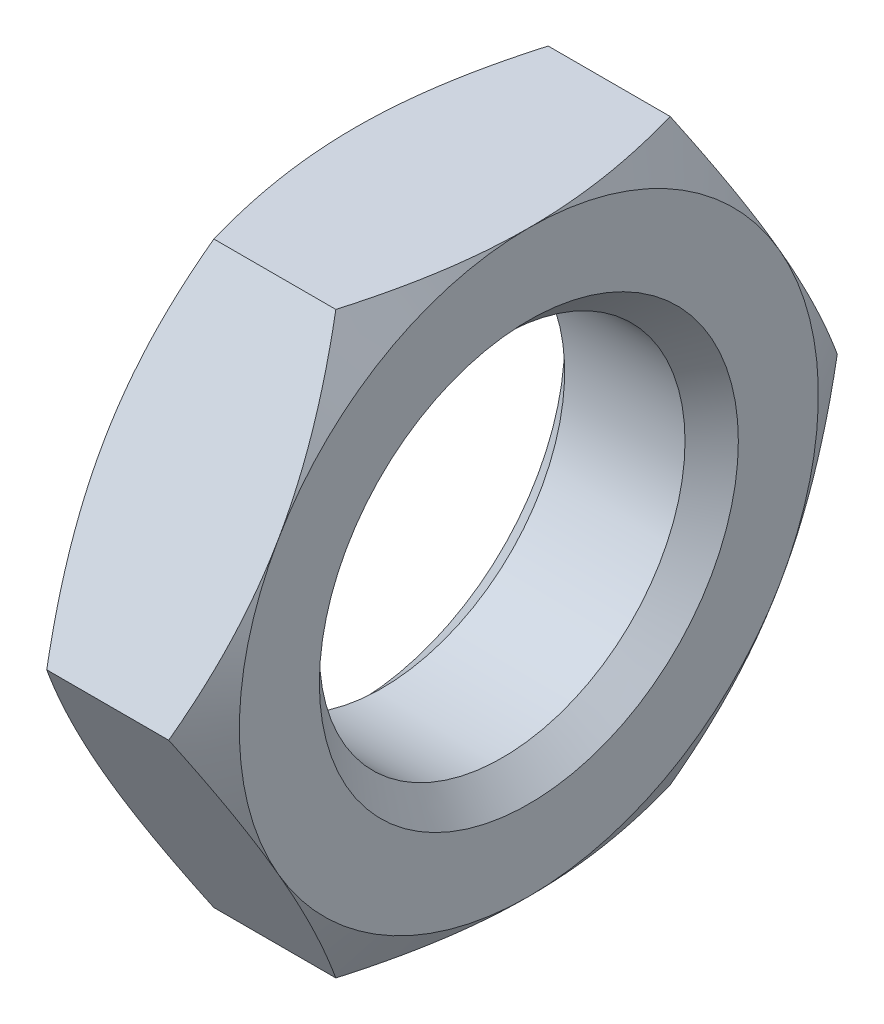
from build123d import *

# Parameters (mm, degrees)
SKETCH1_R      = 6
EXTRUDE1_DEPTH = 5.7
CHAMFER1_SIZE  = 0.875


with BuildPart() as part:
    # Sketch1 → Extrude1 (new body)
    with BuildSketch(Plane(origin=(0, 0, 0), x_dir=(0, 0, -1), z_dir=(1, 0, 0))):
        Polygon((5.484827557, 9.5), (-5.484827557, 9.5), (-10.969655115, 0), (-5.484827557, -9.5), (5.484827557, -9.5), (10.969655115, 0), align=None)
        Circle(SKETCH1_R, mode=Mode.SUBTRACT)
    extrude(amount=EXTRUDE1_DEPTH)

    # Sketch2 → Cut-Revolve1 (revolve, cut)
    with BuildSketch(Plane.XY):
        Polygon((5.7, 9.5), (5.7, 38), (0, 38), (0, 9.5), (2.85, 14.436344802), align=None)
    revolve(axis=Axis((5.7, 0, 0), (-1, 0, 0)), mode=Mode.SUBTRACT)

    # Chamfer1
    chamfer1_edges = [part.edges().sort_by_distance(p)[0] for p in [
        (0, 0, 6),
        (5.7, 0, 6),
    ]]
    chamfer(chamfer1_edges, length=CHAMFER1_SIZE)


solid = part.part
